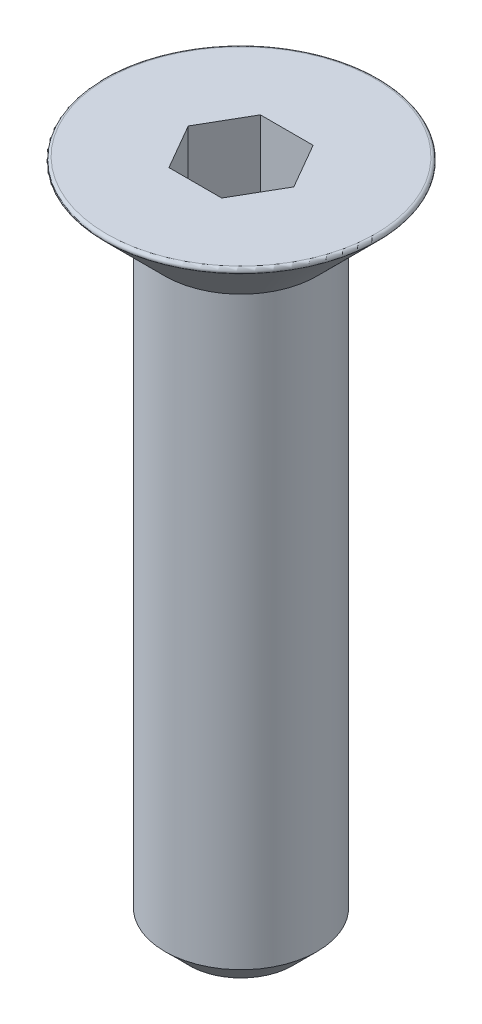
ISO-10303-21;
HEADER;
FILE_DESCRIPTION(('STEP AP214'),'2;1');
FILE_NAME('part.step','',(''),(''),'','','');
FILE_SCHEMA(('AUTOMOTIVE_DESIGN { 1 0 10303 214 1 1 1 1 }'));
ENDSEC;
DATA;
#1=APPLICATION_CONTEXT('core data for automotive mechanical design processes');
#2=APPLICATION_PROTOCOL_DEFINITION('international standard','automotive_design',2000,#1);
#3=PRODUCT_CONTEXT('',#1,'mechanical');
#4=PRODUCT('Part','Part','',(#3));
#5=PRODUCT_RELATED_PRODUCT_CATEGORY('part','',(#4));
#6=PRODUCT_DEFINITION_FORMATION('','',#4);
#7=PRODUCT_DEFINITION_CONTEXT('part definition',#1,'design');
#8=PRODUCT_DEFINITION('design','',#6,#7);
#9=PRODUCT_DEFINITION_SHAPE('','',#8);
#10=(LENGTH_UNIT() NAMED_UNIT(*) SI_UNIT(.MILLI.,.METRE.));
#11=(NAMED_UNIT(*) PLANE_ANGLE_UNIT() SI_UNIT($,.RADIAN.));
#12=(NAMED_UNIT(*) SI_UNIT($,.STERADIAN.) SOLID_ANGLE_UNIT());
#13=UNCERTAINTY_MEASURE_WITH_UNIT(LENGTH_MEASURE(1.E-05),#10,'distance_accuracy_value','');
#14=(GEOMETRIC_REPRESENTATION_CONTEXT(3) GLOBAL_UNCERTAINTY_ASSIGNED_CONTEXT((#13)) GLOBAL_UNIT_ASSIGNED_CONTEXT((#10,
#11,#12)) REPRESENTATION_CONTEXT('',''));
#15=CARTESIAN_POINT('',(0.,0.,0.));
#16=DIRECTION('',(0.,0.,1.));
#17=DIRECTION('',(1.,0.,0.));
#18=AXIS2_PLACEMENT_3D('',#15,#16,#17);
#19=CARTESIAN_POINT('',(0.,0.,0.));
#20=DIRECTION('',(0.,1.,0.));
#21=DIRECTION('',(0.,0.,1.));
#22=AXIS2_PLACEMENT_3D('',#19,#20,#21);
#23=PLANE('',#22);
#24=DIRECTION('',(0.5,0.,-0.866025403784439));
#25=VECTOR('',#24,1.);
#26=CARTESIAN_POINT('',(0.866025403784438,0.,1.5));
#27=LINE('',#26,#25);
#28=CARTESIAN_POINT('',(0.866025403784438,0.,1.5));
#29=VERTEX_POINT('',#28);
#30=CARTESIAN_POINT('',(1.73205080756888,0.,0.));
#31=VERTEX_POINT('',#30);
#32=EDGE_CURVE('E48',#29,#31,#27,.T.);
#33=ORIENTED_EDGE('',*,*,#32,.F.);
#34=DIRECTION('',(1.,0.,0.));
#35=VECTOR('',#34,1.);
#36=CARTESIAN_POINT('',(-0.866025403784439,0.,1.5));
#37=LINE('',#36,#35);
#38=CARTESIAN_POINT('',(-0.866025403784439,0.,1.5));
#39=VERTEX_POINT('',#38);
#40=EDGE_CURVE('E131',#39,#29,#37,.T.);
#41=ORIENTED_EDGE('',*,*,#40,.F.);
#42=DIRECTION('',(0.5,0.,0.866025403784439));
#43=VECTOR('',#42,1.);
#44=CARTESIAN_POINT('',(-1.73205080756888,0.,0.));
#45=LINE('',#44,#43);
#46=CARTESIAN_POINT('',(-1.73205080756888,0.,0.));
#47=VERTEX_POINT('',#46);
#48=EDGE_CURVE('E129',#47,#39,#45,.T.);
#49=ORIENTED_EDGE('',*,*,#48,.F.);
#50=DIRECTION('',(-0.5,0.,0.866025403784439));
#51=VECTOR('',#50,1.);
#52=CARTESIAN_POINT('',(-0.866025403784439,0.,-1.5));
#53=LINE('',#52,#51);
#54=CARTESIAN_POINT('',(-0.866025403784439,0.,-1.5));
#55=VERTEX_POINT('',#54);
#56=EDGE_CURVE('E96',#55,#47,#53,.T.);
#57=ORIENTED_EDGE('',*,*,#56,.F.);
#58=DIRECTION('',(-1.,0.,0.));
#59=VECTOR('',#58,1.);
#60=CARTESIAN_POINT('',(0.866025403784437,0.,-1.5));
#61=LINE('',#60,#59);
#62=CARTESIAN_POINT('',(0.866025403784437,0.,-1.5));
#63=VERTEX_POINT('',#62);
#64=EDGE_CURVE('E125',#63,#55,#61,.T.);
#65=ORIENTED_EDGE('',*,*,#64,.F.);
#66=DIRECTION('',(-0.5,0.,-0.866025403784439));
#67=VECTOR('',#66,1.);
#68=CARTESIAN_POINT('',(1.73205080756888,0.,0.));
#69=LINE('',#68,#67);
#70=EDGE_CURVE('E122',#31,#63,#69,.T.);
#71=ORIENTED_EDGE('',*,*,#70,.F.);
#72=EDGE_LOOP('',(#33,#41,#49,#57,#65,#71));
#73=FACE_BOUND('',#72,.T.);
#74=CARTESIAN_POINT('',(0.,0.,0.));
#75=DIRECTION('',(0.,1.,0.));
#76=DIRECTION('',(0.,0.,1.));
#77=AXIS2_PLACEMENT_3D('',#74,#75,#76);
#78=CIRCLE('',#77,4.40857864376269);
#79=CARTESIAN_POINT('',(0.,0.,4.40857864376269));
#80=VERTEX_POINT('',#79);
#81=EDGE_CURVE('E143',#80,#80,#78,.T.);
#82=ORIENTED_EDGE('',*,*,#81,.T.);
#83=EDGE_LOOP('',(#82));
#84=FACE_BOUND('',#83,.T.);
#85=ADVANCED_FACE('F33',(#73,#84),#23,.T.);
#86=CARTESIAN_POINT('',(0.,0.,0.));
#87=DIRECTION('',(0.,1.,0.));
#88=DIRECTION('',(0.,0.,1.));
#89=AXIS2_PLACEMENT_3D('',#86,#87,#88);
#90=CONICAL_SURFACE('',#89,4.65,0.78539816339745);
#91=CARTESIAN_POINT('',(0.,-0.170710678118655,0.));
#92=DIRECTION('',(0.,-1.,0.));
#93=DIRECTION('',(0.,0.,-1.));
#94=AXIS2_PLACEMENT_3D('',#91,#92,#93);
#95=CIRCLE('',#94,4.47928932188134);
#96=CARTESIAN_POINT('',(0.,-0.170710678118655,-4.47928932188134));
#97=VERTEX_POINT('',#96);
#98=EDGE_CURVE('E146',#97,#97,#95,.T.);
#99=ORIENTED_EDGE('',*,*,#98,.T.);
#100=EDGE_LOOP('',(#99));
#101=FACE_BOUND('',#100,.T.);
#102=CARTESIAN_POINT('',(0.,-2.15,0.));
#103=DIRECTION('',(0.,1.,0.));
#104=DIRECTION('',(0.,0.,1.));
#105=AXIS2_PLACEMENT_3D('',#102,#103,#104);
#106=CIRCLE('',#105,2.5);
#107=CARTESIAN_POINT('',(0.,-2.15,2.5));
#108=VERTEX_POINT('',#107);
#109=EDGE_CURVE('E135',#108,#108,#106,.T.);
#110=ORIENTED_EDGE('',*,*,#109,.T.);
#111=EDGE_LOOP('',(#110));
#112=FACE_BOUND('',#111,.T.);
#113=ADVANCED_FACE('F168',(#101,#112),#90,.T.);
#114=CARTESIAN_POINT('',(0.,15.4879719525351,0.));
#115=DIRECTION('',(0.,1.,0.));
#116=DIRECTION('',(0.,0.,1.));
#117=AXIS2_PLACEMENT_3D('',#114,#115,#116);
#118=CYLINDRICAL_SURFACE('',#117,2.5);
#119=CARTESIAN_POINT('',(0.,-21.35,0.));
#120=DIRECTION('',(0.,-1.,0.));
#121=DIRECTION('',(0.,0.,-1.));
#122=AXIS2_PLACEMENT_3D('',#119,#120,#121);
#123=CIRCLE('',#122,2.5);
#124=CARTESIAN_POINT('',(0.,-21.35,-2.5));
#125=VERTEX_POINT('',#124);
#126=EDGE_CURVE('E41',#125,#125,#123,.F.);
#127=ORIENTED_EDGE('',*,*,#126,.T.);
#128=EDGE_LOOP('',(#127));
#129=FACE_BOUND('',#128,.T.);
#130=ORIENTED_EDGE('',*,*,#109,.F.);
#131=EDGE_LOOP('',(#130));
#132=FACE_BOUND('',#131,.T.);
#133=ADVANCED_FACE('F151',(#129,#132),#118,.T.);
#134=CARTESIAN_POINT('',(2.5,-22.15,0.));
#135=DIRECTION('',(0.,-1.,0.));
#136=DIRECTION('',(0.,0.,-1.));
#137=AXIS2_PLACEMENT_3D('',#134,#135,#136);
#138=PLANE('',#137);
#139=CARTESIAN_POINT('',(0.,-22.15,0.));
#140=DIRECTION('',(0.,-1.,0.));
#141=DIRECTION('',(0.,0.,-1.));
#142=AXIS2_PLACEMENT_3D('',#139,#140,#141);
#143=CIRCLE('',#142,1.69999999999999);
#144=CARTESIAN_POINT('',(0.,-22.15,-1.69999999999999));
#145=VERTEX_POINT('',#144);
#146=EDGE_CURVE('E11',#145,#145,#143,.T.);
#147=ORIENTED_EDGE('',*,*,#146,.T.);
#148=EDGE_LOOP('',(#147));
#149=FACE_BOUND('',#148,.T.);
#150=ADVANCED_FACE('F164',(#149),#138,.T.);
#151=CARTESIAN_POINT('',(0.,-0.1,0.));
#152=DIRECTION('',(0.,1.,0.));
#153=DIRECTION('',(0.,0.,1.));
#154=AXIS2_PLACEMENT_3D('',#151,#152,#153);
#155=TOROIDAL_SURFACE('',#154,4.40857864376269,0.1);
#156=ORIENTED_EDGE('',*,*,#98,.F.);
#157=EDGE_LOOP('',(#156));
#158=FACE_BOUND('',#157,.T.);
#159=ORIENTED_EDGE('',*,*,#81,.F.);
#160=EDGE_LOOP('',(#159));
#161=FACE_BOUND('',#160,.T.);
#162=ADVANCED_FACE('F156',(#158,#161),#155,.T.);
#163=CARTESIAN_POINT('',(0.,-21.35,0.));
#164=DIRECTION('',(0.,1.,0.));
#165=DIRECTION('',(0.,0.,1.));
#166=AXIS2_PLACEMENT_3D('',#163,#164,#165);
#167=CONICAL_SURFACE('',#166,2.5,0.785398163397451);
#168=ORIENTED_EDGE('',*,*,#146,.F.);
#169=EDGE_LOOP('',(#168));
#170=FACE_BOUND('',#169,.T.);
#171=ORIENTED_EDGE('',*,*,#126,.F.);
#172=EDGE_LOOP('',(#171));
#173=FACE_BOUND('',#172,.T.);
#174=ADVANCED_FACE('F35',(#170,#173),#167,.T.);
#175=CARTESIAN_POINT('',(0.866025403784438,-3.,1.5));
#176=DIRECTION('',(0.866025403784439,0.,0.5));
#177=DIRECTION('',(0.5,0.,-0.866025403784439));
#178=AXIS2_PLACEMENT_3D('',#175,#176,#177);
#179=PLANE('',#178);
#180=ORIENTED_EDGE('',*,*,#32,.T.);
#181=DIRECTION('',(0.,1.,0.));
#182=VECTOR('',#181,1.);
#183=CARTESIAN_POINT('',(1.73205080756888,-3.,0.));
#184=LINE('',#183,#182);
#185=CARTESIAN_POINT('',(1.73205080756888,-3.,0.));
#186=VERTEX_POINT('',#185);
#187=EDGE_CURVE('E78',#186,#31,#184,.T.);
#188=ORIENTED_EDGE('',*,*,#187,.F.);
#189=DIRECTION('',(0.5,0.,-0.866025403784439));
#190=VECTOR('',#189,1.);
#191=CARTESIAN_POINT('',(0.866025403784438,-3.,1.5));
#192=LINE('',#191,#190);
#193=CARTESIAN_POINT('',(0.866025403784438,-3.,1.5));
#194=VERTEX_POINT('',#193);
#195=EDGE_CURVE('E133',#194,#186,#192,.T.);
#196=ORIENTED_EDGE('',*,*,#195,.F.);
#197=DIRECTION('',(0.,1.,0.));
#198=VECTOR('',#197,1.);
#199=CARTESIAN_POINT('',(0.866025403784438,-3.,1.5));
#200=LINE('',#199,#198);
#201=EDGE_CURVE('E56',#194,#29,#200,.T.);
#202=ORIENTED_EDGE('',*,*,#201,.T.);
#203=EDGE_LOOP('',(#180,#188,#196,#202));
#204=FACE_BOUND('',#203,.T.);
#205=ADVANCED_FACE('F155',(#204),#179,.F.);
#206=CARTESIAN_POINT('',(-0.866025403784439,-3.,1.5));
#207=DIRECTION('',(0.,0.,1.));
#208=DIRECTION('',(1.,0.,0.));
#209=AXIS2_PLACEMENT_3D('',#206,#207,#208);
#210=PLANE('',#209);
#211=ORIENTED_EDGE('',*,*,#40,.T.);
#212=ORIENTED_EDGE('',*,*,#201,.F.);
#213=DIRECTION('',(1.,0.,0.));
#214=VECTOR('',#213,1.);
#215=CARTESIAN_POINT('',(-0.866025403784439,-3.,1.5));
#216=LINE('',#215,#214);
#217=CARTESIAN_POINT('',(-0.866025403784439,-3.,1.5));
#218=VERTEX_POINT('',#217);
#219=EDGE_CURVE('E108',#218,#194,#216,.T.);
#220=ORIENTED_EDGE('',*,*,#219,.F.);
#221=DIRECTION('',(0.,1.,0.));
#222=VECTOR('',#221,1.);
#223=CARTESIAN_POINT('',(-0.866025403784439,-3.,1.5));
#224=LINE('',#223,#222);
#225=EDGE_CURVE('E100',#218,#39,#224,.T.);
#226=ORIENTED_EDGE('',*,*,#225,.T.);
#227=EDGE_LOOP('',(#211,#212,#220,#226));
#228=FACE_BOUND('',#227,.T.);
#229=ADVANCED_FACE('F162',(#228),#210,.F.);
#230=CARTESIAN_POINT('',(-1.73205080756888,-3.,0.));
#231=DIRECTION('',(-0.866025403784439,0.,0.5));
#232=DIRECTION('',(0.5,0.,0.866025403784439));
#233=AXIS2_PLACEMENT_3D('',#230,#231,#232);
#234=PLANE('',#233);
#235=ORIENTED_EDGE('',*,*,#48,.T.);
#236=ORIENTED_EDGE('',*,*,#225,.F.);
#237=DIRECTION('',(0.5,0.,0.866025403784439));
#238=VECTOR('',#237,1.);
#239=CARTESIAN_POINT('',(-1.73205080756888,-3.,0.));
#240=LINE('',#239,#238);
#241=CARTESIAN_POINT('',(-1.73205080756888,-3.,0.));
#242=VERTEX_POINT('',#241);
#243=EDGE_CURVE('E104',#242,#218,#240,.T.);
#244=ORIENTED_EDGE('',*,*,#243,.F.);
#245=DIRECTION('',(0.,1.,0.));
#246=VECTOR('',#245,1.);
#247=CARTESIAN_POINT('',(-1.73205080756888,-3.,0.));
#248=LINE('',#247,#246);
#249=EDGE_CURVE('E89',#242,#47,#248,.T.);
#250=ORIENTED_EDGE('',*,*,#249,.T.);
#251=EDGE_LOOP('',(#235,#236,#244,#250));
#252=FACE_BOUND('',#251,.T.);
#253=ADVANCED_FACE('F105',(#252),#234,.F.);
#254=CARTESIAN_POINT('',(-0.866025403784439,-3.,-1.5));
#255=DIRECTION('',(-0.866025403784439,0.,-0.5));
#256=DIRECTION('',(-0.5,0.,0.866025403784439));
#257=AXIS2_PLACEMENT_3D('',#254,#255,#256);
#258=PLANE('',#257);
#259=ORIENTED_EDGE('',*,*,#56,.T.);
#260=ORIENTED_EDGE('',*,*,#249,.F.);
#261=DIRECTION('',(-0.5,0.,0.866025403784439));
#262=VECTOR('',#261,1.);
#263=CARTESIAN_POINT('',(-0.866025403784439,-3.,-1.5));
#264=LINE('',#263,#262);
#265=CARTESIAN_POINT('',(-0.866025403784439,-3.,-1.5));
#266=VERTEX_POINT('',#265);
#267=EDGE_CURVE('E93',#266,#242,#264,.T.);
#268=ORIENTED_EDGE('',*,*,#267,.F.);
#269=DIRECTION('',(0.,1.,0.));
#270=VECTOR('',#269,1.);
#271=CARTESIAN_POINT('',(-0.866025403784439,-3.,-1.5));
#272=LINE('',#271,#270);
#273=EDGE_CURVE('E101',#266,#55,#272,.T.);
#274=ORIENTED_EDGE('',*,*,#273,.T.);
#275=EDGE_LOOP('',(#259,#260,#268,#274));
#276=FACE_BOUND('',#275,.T.);
#277=ADVANCED_FACE('F91',(#276),#258,.F.);
#278=CARTESIAN_POINT('',(0.866025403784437,-3.,-1.5));
#279=DIRECTION('',(0.,0.,-1.));
#280=DIRECTION('',(-1.,0.,0.));
#281=AXIS2_PLACEMENT_3D('',#278,#279,#280);
#282=PLANE('',#281);
#283=ORIENTED_EDGE('',*,*,#64,.T.);
#284=ORIENTED_EDGE('',*,*,#273,.F.);
#285=DIRECTION('',(-1.,0.,0.));
#286=VECTOR('',#285,1.);
#287=CARTESIAN_POINT('',(0.866025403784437,-3.,-1.5));
#288=LINE('',#287,#286);
#289=CARTESIAN_POINT('',(0.866025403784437,-3.,-1.5));
#290=VERTEX_POINT('',#289);
#291=EDGE_CURVE('E114',#290,#266,#288,.T.);
#292=ORIENTED_EDGE('',*,*,#291,.F.);
#293=DIRECTION('',(0.,1.,0.));
#294=VECTOR('',#293,1.);
#295=CARTESIAN_POINT('',(0.866025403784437,-3.,-1.5));
#296=LINE('',#295,#294);
#297=EDGE_CURVE('E138',#290,#63,#296,.T.);
#298=ORIENTED_EDGE('',*,*,#297,.T.);
#299=EDGE_LOOP('',(#283,#284,#292,#298));
#300=FACE_BOUND('',#299,.T.);
#301=ADVANCED_FACE('F186',(#300),#282,.F.);
#302=CARTESIAN_POINT('',(1.73205080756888,-3.,0.));
#303=DIRECTION('',(0.866025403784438,0.,-0.5));
#304=DIRECTION('',(-0.5,0.,-0.866025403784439));
#305=AXIS2_PLACEMENT_3D('',#302,#303,#304);
#306=PLANE('',#305);
#307=ORIENTED_EDGE('',*,*,#70,.T.);
#308=ORIENTED_EDGE('',*,*,#297,.F.);
#309=DIRECTION('',(-0.5,0.,-0.866025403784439));
#310=VECTOR('',#309,1.);
#311=CARTESIAN_POINT('',(1.73205080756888,-3.,0.));
#312=LINE('',#311,#310);
#313=EDGE_CURVE('E116',#186,#290,#312,.T.);
#314=ORIENTED_EDGE('',*,*,#313,.F.);
#315=ORIENTED_EDGE('',*,*,#187,.T.);
#316=EDGE_LOOP('',(#307,#308,#314,#315));
#317=FACE_BOUND('',#316,.T.);
#318=ADVANCED_FACE('F183',(#317),#306,.F.);
#319=CARTESIAN_POINT('',(1.73205080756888,-3.,0.));
#320=DIRECTION('',(0.,1.,0.));
#321=DIRECTION('',(0.,0.,1.));
#322=AXIS2_PLACEMENT_3D('',#319,#320,#321);
#323=PLANE('',#322);
#324=ORIENTED_EDGE('',*,*,#195,.T.);
#325=ORIENTED_EDGE('',*,*,#313,.T.);
#326=ORIENTED_EDGE('',*,*,#291,.T.);
#327=ORIENTED_EDGE('',*,*,#267,.T.);
#328=ORIENTED_EDGE('',*,*,#243,.T.);
#329=ORIENTED_EDGE('',*,*,#219,.T.);
#330=EDGE_LOOP('',(#324,#325,#326,#327,#328,#329));
#331=FACE_BOUND('',#330,.T.);
#332=ADVANCED_FACE('F111',(#331),#323,.T.);
#333=CLOSED_SHELL('',(#85,#113,#133,#150,#162,#174,#205,#229,#253,#277,#301,#318,#332));
#334=MANIFOLD_SOLID_BREP('B2',#333);
#335=ADVANCED_BREP_SHAPE_REPRESENTATION('',(#18,#334),#14);
#336=SHAPE_DEFINITION_REPRESENTATION(#9,#335);
ENDSEC;
END-ISO-10303-21;
